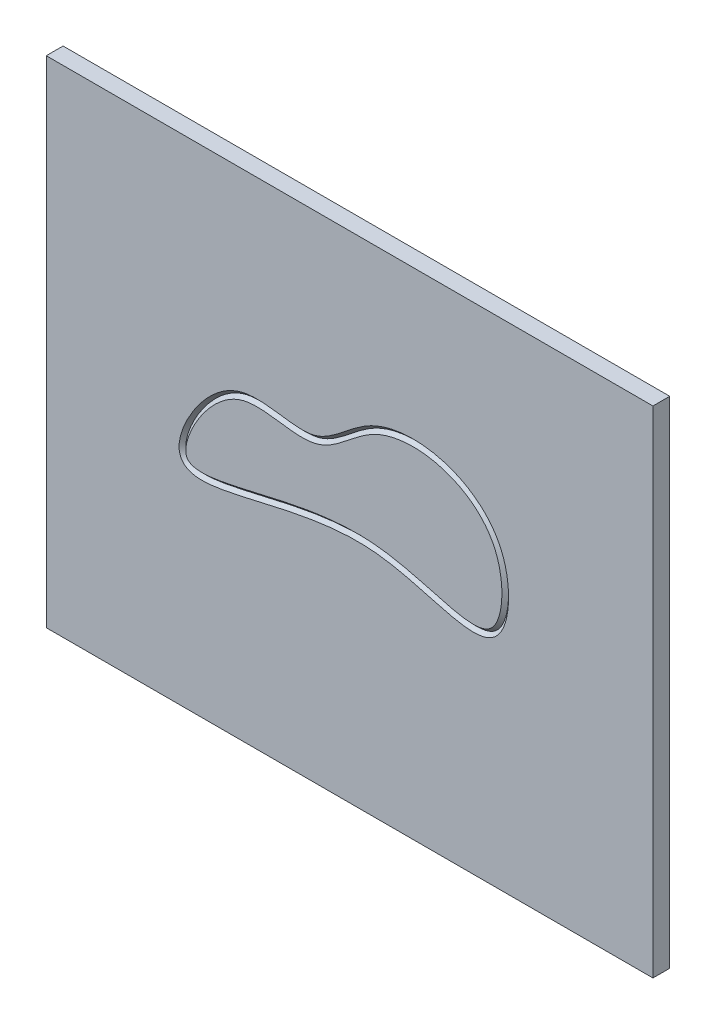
ISO-10303-21;
HEADER;
FILE_DESCRIPTION(('STEP AP214'),'2;1');
FILE_NAME('part.step','',(''),(''),'','','');
FILE_SCHEMA(('AUTOMOTIVE_DESIGN { 1 0 10303 214 1 1 1 1 }'));
ENDSEC;
DATA;
#1=APPLICATION_CONTEXT('core data for automotive mechanical design processes');
#2=APPLICATION_PROTOCOL_DEFINITION('international standard','automotive_design',2000,#1);
#3=PRODUCT_CONTEXT('',#1,'mechanical');
#4=PRODUCT('Part','Part','',(#3));
#5=PRODUCT_RELATED_PRODUCT_CATEGORY('part','',(#4));
#6=PRODUCT_DEFINITION_FORMATION('','',#4);
#7=PRODUCT_DEFINITION_CONTEXT('part definition',#1,'design');
#8=PRODUCT_DEFINITION('design','',#6,#7);
#9=PRODUCT_DEFINITION_SHAPE('','',#8);
#10=(LENGTH_UNIT() NAMED_UNIT(*) SI_UNIT(.MILLI.,.METRE.));
#11=(NAMED_UNIT(*) PLANE_ANGLE_UNIT() SI_UNIT($,.RADIAN.));
#12=(NAMED_UNIT(*) SI_UNIT($,.STERADIAN.) SOLID_ANGLE_UNIT());
#13=UNCERTAINTY_MEASURE_WITH_UNIT(LENGTH_MEASURE(1.E-05),#10,'distance_accuracy_value','');
#14=(GEOMETRIC_REPRESENTATION_CONTEXT(3) GLOBAL_UNCERTAINTY_ASSIGNED_CONTEXT((#13)) GLOBAL_UNIT_ASSIGNED_CONTEXT((#10,
#11,#12)) REPRESENTATION_CONTEXT('',''));
#15=CARTESIAN_POINT('',(0.,0.,0.));
#16=DIRECTION('',(0.,0.,1.));
#17=DIRECTION('',(1.,0.,0.));
#18=AXIS2_PLACEMENT_3D('',#15,#16,#17);
#19=CARTESIAN_POINT('',(0.,442.323223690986,15.));
#20=DIRECTION('',(0.,0.,-1.));
#21=DIRECTION('',(-1.,0.,0.));
#22=AXIS2_PLACEMENT_3D('',#19,#20,#21);
#23=PLANE('',#22);
#24=CARTESIAN_POINT('',(238.94227801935,268.42674909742,15.));
#25=CARTESIAN_POINT('',(233.076366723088,266.986429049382,15.));
#26=CARTESIAN_POINT('',(220.373399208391,267.218195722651,15.));
#27=CARTESIAN_POINT('',(202.101285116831,270.366087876,15.));
#28=CARTESIAN_POINT('',(187.098912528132,271.250733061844,15.));
#29=CARTESIAN_POINT('',(177.870382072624,270.372084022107,15.));
#30=CARTESIAN_POINT('',(170.392286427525,268.332501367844,15.));
#31=CARTESIAN_POINT('',(163.071572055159,265.281610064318,15.));
#32=CARTESIAN_POINT('',(153.135729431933,258.930835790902,15.));
#33=CARTESIAN_POINT('',(141.862274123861,248.195327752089,15.));
#34=CARTESIAN_POINT('',(131.624091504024,234.615519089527,15.));
#35=CARTESIAN_POINT('',(124.534237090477,221.770129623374,15.));
#36=CARTESIAN_POINT('',(120.274187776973,210.775490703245,15.));
#37=CARTESIAN_POINT('',(118.798024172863,204.024514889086,15.));
#38=CARTESIAN_POINT('',(118.572542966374,200.302872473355,15.));
#39=CARTESIAN_POINT('',(118.575468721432,198.255373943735,15.));
#40=CARTESIAN_POINT('',(118.772703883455,196.039969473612,15.));
#41=CARTESIAN_POINT('',(119.462313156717,193.350755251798,15.));
#42=CARTESIAN_POINT('',(120.605729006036,190.92483039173,15.));
#43=CARTESIAN_POINT('',(122.253965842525,188.74196610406,15.));
#44=CARTESIAN_POINT('',(124.396872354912,186.912238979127,15.));
#45=CARTESIAN_POINT('',(126.976524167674,185.495920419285,15.));
#46=CARTESIAN_POINT('',(129.839604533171,184.502470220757,15.));
#47=CARTESIAN_POINT('',(132.958956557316,183.865587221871,15.));
#48=CARTESIAN_POINT('',(137.412285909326,183.425674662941,15.));
#49=CARTESIAN_POINT('',(143.562085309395,183.520093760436,15.));
#50=CARTESIAN_POINT('',(161.679751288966,185.528291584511,15.));
#51=CARTESIAN_POINT('',(198.086066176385,194.651377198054,15.));
#52=CARTESIAN_POINT('',(248.574302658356,205.127435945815,15.));
#53=CARTESIAN_POINT('',(287.223477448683,206.412172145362,15.));
#54=CARTESIAN_POINT('',(323.891948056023,200.747530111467,15.));
#55=CARTESIAN_POINT('',(350.771567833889,192.014741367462,15.));
#56=CARTESIAN_POINT('',(370.239796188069,188.12230228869,15.));
#57=CARTESIAN_POINT('',(378.062168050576,187.181368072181,15.));
#58=CARTESIAN_POINT('',(385.35476326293,187.190783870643,15.));
#59=CARTESIAN_POINT('',(392.108143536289,188.421213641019,15.));
#60=CARTESIAN_POINT('',(397.71009229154,190.964066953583,15.));
#61=CARTESIAN_POINT('',(401.523625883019,194.061252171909,15.));
#62=CARTESIAN_POINT('',(403.858164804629,196.728611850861,15.));
#63=CARTESIAN_POINT('',(405.974549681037,199.715404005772,15.));
#64=CARTESIAN_POINT('',(408.172973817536,203.885357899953,15.));
#65=CARTESIAN_POINT('',(410.242740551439,209.668937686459,15.));
#66=CARTESIAN_POINT('',(412.458317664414,219.208797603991,15.));
#67=CARTESIAN_POINT('',(413.362999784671,233.532909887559,15.));
#68=CARTESIAN_POINT('',(410.926313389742,250.692650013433,15.));
#69=CARTESIAN_POINT('',(406.737447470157,262.592202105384,15.));
#70=CARTESIAN_POINT('',(401.105772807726,273.532260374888,15.));
#71=CARTESIAN_POINT('',(392.796644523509,284.478192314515,15.));
#72=CARTESIAN_POINT('',(378.655432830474,295.840277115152,15.));
#73=CARTESIAN_POINT('',(362.295032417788,303.984449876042,15.));
#74=CARTESIAN_POINT('',(344.574552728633,308.846171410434,15.));
#75=CARTESIAN_POINT('',(325.583498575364,310.399047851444,15.));
#76=CARTESIAN_POINT('',(307.009959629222,308.149906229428,15.));
#77=CARTESIAN_POINT('',(294.513894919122,303.62812566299,15.));
#78=CARTESIAN_POINT('',(283.017290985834,297.599141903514,15.));
#79=CARTESIAN_POINT('',(271.061200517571,288.923435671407,15.));
#80=CARTESIAN_POINT('',(255.412215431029,275.754969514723,15.));
#81=CARTESIAN_POINT('',(244.74953020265,269.852665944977,15.));
#82=CARTESIAN_POINT('',(238.94227801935,268.42674909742,15.));
#83=B_SPLINE_CURVE_WITH_KNOTS('',3,(#24,#25,#26,#27,#28,#29,#30,#31,#32,#33,#34,#35,#36,#37,#38,
#39,#40,#41,#42,#43,#44,#45,#46,#47,#48,#49,#50,#51,#52,#53,#54,#55,#56,#57,#58,#59,#60,#61,#62,
#63,#64,#65,#66,#67,#68,#69,#70,#71,#72,#73,#74,#75,#76,#77,#78,#79,#80,#81,#82),.UNSPECIFIED.,
.T.,.F.,(4,1,1,1,1,1,1,1,1,1,1,1,1,1,1,1,1,1,1,1,1,1,1,1,1,1,1,1,1,1,1,1,1,1,1,1,1,1,1,1,1,1,1,
1,1,1,1,1,1,1,1,1,1,1,1,1,4),(0.,0.03125,0.0625,0.078125,0.09375,0.100630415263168,0.109375,
0.125000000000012,0.145833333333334,0.166666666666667,0.1875,0.203125,0.21875,0.223293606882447,
0.225,0.23125,0.2375,0.24375,0.25,0.257,0.264,0.271,0.278,0.285,0.298750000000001,0.3125,0.375,
0.4375,0.473210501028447,0.499999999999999,0.5625,0.575,0.5875,0.6,0.612499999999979,
0.62500000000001,0.634375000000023,0.639427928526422,0.64375,0.653125,0.6625,0.671875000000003,
0.6953125,0.71875,0.736109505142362,0.742187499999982,0.765625,0.7890625,0.8125,0.8359375,
0.859375,0.885625,0.908781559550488,0.911874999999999,0.938125,0.9690625,1.),.UNSPECIFIED.);
#84=CARTESIAN_POINT('',(238.94227801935,268.42674909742,15.));
#85=VERTEX_POINT('',#84);
#86=EDGE_CURVE('E132',#85,#85,#83,.T.);
#87=ORIENTED_EDGE('',*,*,#86,.F.);
#88=EDGE_LOOP('',(#87));
#89=FACE_BOUND('',#88,.T.);
#90=DIRECTION('',(0.,-1.,0.));
#91=VECTOR('',#90,1.);
#92=CARTESIAN_POINT('',(0.,0.,15.));
#93=LINE('',#92,#91);
#94=CARTESIAN_POINT('',(0.,442.323223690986,15.));
#95=VERTEX_POINT('',#94);
#96=CARTESIAN_POINT('',(0.,0.,15.));
#97=VERTEX_POINT('',#96);
#98=EDGE_CURVE('E102',#95,#97,#93,.T.);
#99=ORIENTED_EDGE('',*,*,#98,.T.);
#100=DIRECTION('',(1.,0.,0.));
#101=VECTOR('',#100,1.);
#102=CARTESIAN_POINT('',(0.,0.,15.));
#103=LINE('',#102,#101);
#104=CARTESIAN_POINT('',(541.669056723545,0.,15.));
#105=VERTEX_POINT('',#104);
#106=EDGE_CURVE('E98',#97,#105,#103,.T.);
#107=ORIENTED_EDGE('',*,*,#106,.T.);
#108=DIRECTION('',(0.,1.,0.));
#109=VECTOR('',#108,1.);
#110=CARTESIAN_POINT('',(541.669056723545,0.,15.));
#111=LINE('',#110,#109);
#112=CARTESIAN_POINT('',(541.669056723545,442.323223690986,15.));
#113=VERTEX_POINT('',#112);
#114=EDGE_CURVE('E100',#105,#113,#111,.T.);
#115=ORIENTED_EDGE('',*,*,#114,.T.);
#116=DIRECTION('',(-1.,0.,0.));
#117=VECTOR('',#116,1.);
#118=CARTESIAN_POINT('',(0.,442.323223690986,15.));
#119=LINE('',#118,#117);
#120=EDGE_CURVE('E68',#113,#95,#119,.T.);
#121=ORIENTED_EDGE('',*,*,#120,.T.);
#122=EDGE_LOOP('',(#99,#107,#115,#121));
#123=FACE_BOUND('',#122,.T.);
#124=ADVANCED_FACE('F51',(#89,#123),#23,.F.);
#125=CARTESIAN_POINT('',(0.,0.,15.));
#126=DIRECTION('',(1.,0.,0.));
#127=DIRECTION('',(0.,0.,-1.));
#128=AXIS2_PLACEMENT_3D('',#125,#126,#127);
#129=PLANE('',#128);
#130=DIRECTION('',(0.,-1.,0.));
#131=VECTOR('',#130,1.);
#132=CARTESIAN_POINT('',(0.,0.,0.));
#133=LINE('',#132,#131);
#134=CARTESIAN_POINT('',(0.,442.323223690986,0.));
#135=VERTEX_POINT('',#134);
#136=CARTESIAN_POINT('',(0.,0.,0.));
#137=VERTEX_POINT('',#136);
#138=EDGE_CURVE('E114',#135,#137,#133,.T.);
#139=ORIENTED_EDGE('',*,*,#138,.T.);
#140=DIRECTION('',(0.,0.,-1.));
#141=VECTOR('',#140,1.);
#142=CARTESIAN_POINT('',(0.,0.,15.));
#143=LINE('',#142,#141);
#144=EDGE_CURVE('E12',#97,#137,#143,.T.);
#145=ORIENTED_EDGE('',*,*,#144,.F.);
#146=ORIENTED_EDGE('',*,*,#98,.F.);
#147=DIRECTION('',(0.,0.,-1.));
#148=VECTOR('',#147,1.);
#149=CARTESIAN_POINT('',(0.,442.323223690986,15.));
#150=LINE('',#149,#148);
#151=EDGE_CURVE('E110',#95,#135,#150,.T.);
#152=ORIENTED_EDGE('',*,*,#151,.T.);
#153=EDGE_LOOP('',(#139,#145,#146,#152));
#154=FACE_BOUND('',#153,.T.);
#155=ADVANCED_FACE('F53',(#154),#129,.F.);
#156=CARTESIAN_POINT('',(0.,0.,15.));
#157=DIRECTION('',(0.,1.,0.));
#158=DIRECTION('',(0.,0.,1.));
#159=AXIS2_PLACEMENT_3D('',#156,#157,#158);
#160=PLANE('',#159);
#161=DIRECTION('',(1.,0.,0.));
#162=VECTOR('',#161,1.);
#163=CARTESIAN_POINT('',(0.,0.,0.));
#164=LINE('',#163,#162);
#165=CARTESIAN_POINT('',(541.669056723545,0.,0.));
#166=VERTEX_POINT('',#165);
#167=EDGE_CURVE('E106',#137,#166,#164,.T.);
#168=ORIENTED_EDGE('',*,*,#167,.T.);
#169=DIRECTION('',(0.,0.,-1.));
#170=VECTOR('',#169,1.);
#171=CARTESIAN_POINT('',(541.669056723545,0.,15.));
#172=LINE('',#171,#170);
#173=EDGE_CURVE('E60',#105,#166,#172,.T.);
#174=ORIENTED_EDGE('',*,*,#173,.F.);
#175=ORIENTED_EDGE('',*,*,#106,.F.);
#176=ORIENTED_EDGE('',*,*,#144,.T.);
#177=EDGE_LOOP('',(#168,#174,#175,#176));
#178=FACE_BOUND('',#177,.T.);
#179=ADVANCED_FACE('F105',(#178),#160,.F.);
#180=CARTESIAN_POINT('',(541.669056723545,0.,15.));
#181=DIRECTION('',(-1.,0.,0.));
#182=DIRECTION('',(0.,0.,1.));
#183=AXIS2_PLACEMENT_3D('',#180,#181,#182);
#184=PLANE('',#183);
#185=DIRECTION('',(0.,1.,0.));
#186=VECTOR('',#185,1.);
#187=CARTESIAN_POINT('',(541.669056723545,0.,0.));
#188=LINE('',#187,#186);
#189=CARTESIAN_POINT('',(541.669056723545,442.323223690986,0.));
#190=VERTEX_POINT('',#189);
#191=EDGE_CURVE('E85',#166,#190,#188,.T.);
#192=ORIENTED_EDGE('',*,*,#191,.T.);
#193=DIRECTION('',(0.,0.,-1.));
#194=VECTOR('',#193,1.);
#195=CARTESIAN_POINT('',(541.669056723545,442.323223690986,15.));
#196=LINE('',#195,#194);
#197=EDGE_CURVE('E107',#113,#190,#196,.T.);
#198=ORIENTED_EDGE('',*,*,#197,.F.);
#199=ORIENTED_EDGE('',*,*,#114,.F.);
#200=ORIENTED_EDGE('',*,*,#173,.T.);
#201=EDGE_LOOP('',(#192,#198,#199,#200));
#202=FACE_BOUND('',#201,.T.);
#203=ADVANCED_FACE('F108',(#202),#184,.F.);
#204=CARTESIAN_POINT('',(0.,442.323223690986,15.));
#205=DIRECTION('',(0.,-1.,0.));
#206=DIRECTION('',(0.,0.,-1.));
#207=AXIS2_PLACEMENT_3D('',#204,#205,#206);
#208=PLANE('',#207);
#209=DIRECTION('',(-1.,0.,0.));
#210=VECTOR('',#209,1.);
#211=CARTESIAN_POINT('',(0.,442.323223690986,0.));
#212=LINE('',#211,#210);
#213=EDGE_CURVE('E91',#190,#135,#212,.T.);
#214=ORIENTED_EDGE('',*,*,#213,.T.);
#215=ORIENTED_EDGE('',*,*,#151,.F.);
#216=ORIENTED_EDGE('',*,*,#120,.F.);
#217=ORIENTED_EDGE('',*,*,#197,.T.);
#218=EDGE_LOOP('',(#214,#215,#216,#217));
#219=FACE_BOUND('',#218,.T.);
#220=ADVANCED_FACE('F122',(#219),#208,.F.);
#221=CARTESIAN_POINT('',(0.,442.323223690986,0.));
#222=DIRECTION('',(0.,0.,-1.));
#223=DIRECTION('',(-1.,0.,0.));
#224=AXIS2_PLACEMENT_3D('',#221,#222,#223);
#225=PLANE('',#224);
#226=ORIENTED_EDGE('',*,*,#138,.F.);
#227=ORIENTED_EDGE('',*,*,#213,.F.);
#228=ORIENTED_EDGE('',*,*,#191,.F.);
#229=ORIENTED_EDGE('',*,*,#167,.F.);
#230=EDGE_LOOP('',(#226,#227,#228,#229));
#231=FACE_BOUND('',#230,.T.);
#232=ADVANCED_FACE('F125',(#231),#225,.T.);
#233=CARTESIAN_POINT('',(238.94227801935,268.42674909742,15.));
#234=CARTESIAN_POINT('',(233.076366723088,266.986429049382,15.));
#235=CARTESIAN_POINT('',(220.373399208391,267.218195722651,15.));
#236=CARTESIAN_POINT('',(202.101285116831,270.366087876,15.));
#237=CARTESIAN_POINT('',(187.098912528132,271.250733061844,15.));
#238=CARTESIAN_POINT('',(177.870382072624,270.372084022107,15.));
#239=CARTESIAN_POINT('',(170.392286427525,268.332501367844,15.));
#240=CARTESIAN_POINT('',(163.071572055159,265.281610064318,15.));
#241=CARTESIAN_POINT('',(153.135729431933,258.930835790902,15.));
#242=CARTESIAN_POINT('',(141.862274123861,248.195327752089,15.));
#243=CARTESIAN_POINT('',(131.624091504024,234.615519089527,15.));
#244=CARTESIAN_POINT('',(124.534237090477,221.770129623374,15.));
#245=CARTESIAN_POINT('',(120.274187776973,210.775490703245,15.));
#246=CARTESIAN_POINT('',(118.798024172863,204.024514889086,15.));
#247=CARTESIAN_POINT('',(118.572542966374,200.302872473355,15.));
#248=CARTESIAN_POINT('',(118.575468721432,198.255373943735,15.));
#249=CARTESIAN_POINT('',(118.772703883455,196.039969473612,15.));
#250=CARTESIAN_POINT('',(119.462313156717,193.350755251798,15.));
#251=CARTESIAN_POINT('',(120.605729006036,190.92483039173,15.));
#252=CARTESIAN_POINT('',(122.253965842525,188.74196610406,15.));
#253=CARTESIAN_POINT('',(124.396872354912,186.912238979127,15.));
#254=CARTESIAN_POINT('',(126.976524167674,185.495920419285,15.));
#255=CARTESIAN_POINT('',(129.839604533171,184.502470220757,15.));
#256=CARTESIAN_POINT('',(132.958956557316,183.865587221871,15.));
#257=CARTESIAN_POINT('',(137.412285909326,183.425674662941,15.));
#258=CARTESIAN_POINT('',(143.562085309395,183.520093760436,15.));
#259=CARTESIAN_POINT('',(161.679751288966,185.528291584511,15.));
#260=CARTESIAN_POINT('',(198.086066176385,194.651377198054,15.));
#261=CARTESIAN_POINT('',(248.574302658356,205.127435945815,15.));
#262=CARTESIAN_POINT('',(287.223477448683,206.412172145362,15.));
#263=CARTESIAN_POINT('',(323.891948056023,200.747530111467,15.));
#264=CARTESIAN_POINT('',(350.771567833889,192.014741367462,15.));
#265=CARTESIAN_POINT('',(370.239796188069,188.12230228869,15.));
#266=CARTESIAN_POINT('',(378.062168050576,187.181368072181,15.));
#267=CARTESIAN_POINT('',(385.35476326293,187.190783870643,15.));
#268=CARTESIAN_POINT('',(392.108143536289,188.421213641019,15.));
#269=CARTESIAN_POINT('',(397.71009229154,190.964066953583,15.));
#270=CARTESIAN_POINT('',(401.523625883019,194.061252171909,15.));
#271=CARTESIAN_POINT('',(403.858164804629,196.728611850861,15.));
#272=CARTESIAN_POINT('',(405.974549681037,199.715404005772,15.));
#273=CARTESIAN_POINT('',(408.172973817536,203.885357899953,15.));
#274=CARTESIAN_POINT('',(410.242740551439,209.668937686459,15.));
#275=CARTESIAN_POINT('',(412.458317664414,219.208797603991,15.));
#276=CARTESIAN_POINT('',(413.362999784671,233.532909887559,15.));
#277=CARTESIAN_POINT('',(410.926313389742,250.692650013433,15.));
#278=CARTESIAN_POINT('',(406.737447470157,262.592202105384,15.));
#279=CARTESIAN_POINT('',(401.105772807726,273.532260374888,15.));
#280=CARTESIAN_POINT('',(392.796644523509,284.478192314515,15.));
#281=CARTESIAN_POINT('',(378.655432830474,295.840277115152,15.));
#282=CARTESIAN_POINT('',(362.295032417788,303.984449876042,15.));
#283=CARTESIAN_POINT('',(344.574552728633,308.846171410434,15.));
#284=CARTESIAN_POINT('',(325.583498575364,310.399047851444,15.));
#285=CARTESIAN_POINT('',(307.009959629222,308.149906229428,15.));
#286=CARTESIAN_POINT('',(294.513894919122,303.62812566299,15.));
#287=CARTESIAN_POINT('',(283.017290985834,297.599141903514,15.));
#288=CARTESIAN_POINT('',(271.061200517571,288.923435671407,15.));
#289=CARTESIAN_POINT('',(255.412215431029,275.754969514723,15.));
#290=CARTESIAN_POINT('',(244.74953020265,269.852665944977,15.));
#291=CARTESIAN_POINT('',(238.94227801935,268.42674909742,15.));
#292=CARTESIAN_POINT('',(239.659202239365,265.51367174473,12.));
#293=CARTESIAN_POINT('',(233.38564723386,263.969715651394,12.));
#294=CARTESIAN_POINT('',(219.848762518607,264.24297632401,12.));
#295=CARTESIAN_POINT('',(201.672721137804,267.392493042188,12.));
#296=CARTESIAN_POINT('',(187.110627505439,268.239876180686,12.));
#297=CARTESIAN_POINT('',(178.366641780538,267.39403053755,12.));
#298=CARTESIAN_POINT('',(171.371004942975,265.493508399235,12.));
#299=CARTESIAN_POINT('',(164.520624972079,262.631595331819,12.));
#300=CARTESIAN_POINT('',(155.033101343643,256.58661291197,12.));
#301=CARTESIAN_POINT('',(144.125350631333,246.205740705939,12.));
#302=CARTESIAN_POINT('',(134.146977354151,232.975993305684,12.));
#303=CARTESIAN_POINT('',(127.245324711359,220.463660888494,12.));
#304=CARTESIAN_POINT('',(123.142264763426,209.865390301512,12.));
#305=CARTESIAN_POINT('',(121.771629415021,203.517725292,12.));
#306=CARTESIAN_POINT('',(121.572685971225,200.196225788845,12.));
#307=CARTESIAN_POINT('',(121.575562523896,198.406722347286,12.));
#308=CARTESIAN_POINT('',(121.746116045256,196.52814265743,12.));
#309=CARTESIAN_POINT('',(122.307810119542,194.357198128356,12.));
#310=CARTESIAN_POINT('',(123.195819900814,192.481333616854,12.));
#311=CARTESIAN_POINT('',(124.448030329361,190.823404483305,12.));
#312=CARTESIAN_POINT('',(126.098438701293,189.408885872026,12.));
#313=CARTESIAN_POINT('',(128.179082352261,188.259767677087,12.));
#314=CARTESIAN_POINT('',(130.614396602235,187.409644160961,12.));
#315=CARTESIAN_POINT('',(133.389943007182,186.839720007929,12.));
#316=CARTESIAN_POINT('',(137.488142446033,186.432032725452,12.));
#317=CARTESIAN_POINT('',(143.341335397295,186.515918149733,12.));
#318=CARTESIAN_POINT('',(160.992882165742,188.466318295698,12.));
#319=CARTESIAN_POINT('',(197.368729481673,197.546429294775,12.));
#320=CARTESIAN_POINT('',(248.092154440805,208.128916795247,12.));
#321=CARTESIAN_POINT('',(287.41116060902,209.392473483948,12.));
#322=CARTESIAN_POINT('',(324.687908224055,203.674074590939,12.));
#323=CARTESIAN_POINT('',(351.667102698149,194.888919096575,12.));
#324=CARTESIAN_POINT('',(370.736844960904,191.083976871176,12.));
#325=CARTESIAN_POINT('',(378.272600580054,190.180790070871,12.));
#326=CARTESIAN_POINT('',(385.123236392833,190.197333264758,12.));
#327=CARTESIAN_POINT('',(391.240623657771,191.325833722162,12.));
#328=CARTESIAN_POINT('',(396.131966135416,193.555794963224,12.));
#329=CARTESIAN_POINT('',(399.442444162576,196.242875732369,12.));
#330=CARTESIAN_POINT('',(401.497763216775,198.587302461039,12.));
#331=CARTESIAN_POINT('',(403.387133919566,201.253908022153,12.));
#332=CARTESIAN_POINT('',(405.40934709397,205.07637613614,12.));
#333=CARTESIAN_POINT('',(407.353667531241,210.501403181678,12.));
#334=CARTESIAN_POINT('',(409.465456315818,219.580577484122,12.));
#335=CARTESIAN_POINT('',(410.348641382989,233.401483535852,12.));
#336=CARTESIAN_POINT('',(407.980568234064,250.017562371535,12.));
#337=CARTESIAN_POINT('',(403.965634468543,261.42437520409,12.));
#338=CARTESIAN_POINT('',(398.576402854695,271.887239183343,12.));
#339=CARTESIAN_POINT('',(390.637300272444,282.351430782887,12.));
#340=CARTESIAN_POINT('',(377.037834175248,293.286739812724,12.));
#341=CARTESIAN_POINT('',(361.226513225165,301.16146301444,12.));
#342=CARTESIAN_POINT('',(344.049181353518,305.874358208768,12.));
#343=CARTESIAN_POINT('',(325.643782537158,307.382176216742,12.));
#344=CARTESIAN_POINT('',(307.666742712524,305.189632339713,12.));
#345=CARTESIAN_POINT('',(295.712230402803,300.872503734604,12.));
#346=CARTESIAN_POINT('',(284.639447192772,295.059406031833,12.));
#347=CARTESIAN_POINT('',(272.988522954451,286.632999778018,12.));
#348=CARTESIAN_POINT('',(257.321582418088,273.393506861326,12.));
#349=CARTESIAN_POINT('',(245.870021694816,267.042188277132,12.));
#350=CARTESIAN_POINT('',(239.659202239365,265.51367174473,12.));
#351=B_SPLINE_SURFACE_WITH_KNOTS('',1,3,((#233,#234,#235,#236,#237,#238,#239,#240,#241,#242,
#243,#244,#245,#246,#247,#248,#249,#250,#251,#252,#253,#254,#255,#256,#257,#258,#259,#260,#261,
#262,#263,#264,#265,#266,#267,#268,#269,#270,#271,#272,#273,#274,#275,#276,#277,#278,#279,#280,
#281,#282,#283,#284,#285,#286,#287,#288,#289,#290,#291),(#292,#293,#294,#295,#296,#297,#298,
#299,#300,#301,#302,#303,#304,#305,#306,#307,#308,#309,#310,#311,#312,#313,#314,#315,#316,#317,
#318,#319,#320,#321,#322,#323,#324,#325,#326,#327,#328,#329,#330,#331,#332,#333,#334,#335,#336,
#337,#338,#339,#340,#341,#342,#343,#344,#345,#346,#347,#348,#349,#350)),.UNSPECIFIED.,.F.,.T.,
.F.,(2,2),(4,1,1,1,1,1,1,1,1,1,1,1,1,1,1,1,1,1,1,1,1,1,1,1,1,1,1,1,1,1,1,1,1,1,1,1,1,1,1,1,1,1,
1,1,1,1,1,1,1,1,1,1,1,1,1,1,4),(0.707106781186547,1.),(0.,0.03125,0.0625,0.078125,0.09375,
0.100630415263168,0.109375,0.125000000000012,0.145833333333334,0.166666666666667,0.1875,
0.203125,0.21875,0.223293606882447,0.225,0.23125,0.2375,0.24375,0.25,0.257,0.264,0.271,0.278,
0.285,0.298750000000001,0.3125,0.375,0.4375,0.473210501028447,0.499999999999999,0.5625,0.575,
0.5875,0.6,0.612499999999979,0.62500000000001,0.634375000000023,0.639427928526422,0.64375,
0.653125,0.6625,0.671875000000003,0.6953125,0.71875,0.736109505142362,0.742187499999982,
0.765625,0.7890625,0.8125,0.8359375,0.859375,0.885625,0.908781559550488,0.911874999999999,
0.938125,0.9690625,1.),.UNSPECIFIED.);
#352=CARTESIAN_POINT('',(239.659202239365,265.51367174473,12.));
#353=CARTESIAN_POINT('',(233.38564723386,263.969715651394,12.));
#354=CARTESIAN_POINT('',(219.848762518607,264.24297632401,12.));
#355=CARTESIAN_POINT('',(201.672721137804,267.392493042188,12.));
#356=CARTESIAN_POINT('',(187.110627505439,268.239876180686,12.));
#357=CARTESIAN_POINT('',(178.366641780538,267.39403053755,12.));
#358=CARTESIAN_POINT('',(171.371004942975,265.493508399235,12.));
#359=CARTESIAN_POINT('',(164.520624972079,262.631595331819,12.));
#360=CARTESIAN_POINT('',(155.033101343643,256.58661291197,12.));
#361=CARTESIAN_POINT('',(144.125350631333,246.205740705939,12.));
#362=CARTESIAN_POINT('',(134.146977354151,232.975993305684,12.));
#363=CARTESIAN_POINT('',(127.245324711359,220.463660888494,12.));
#364=CARTESIAN_POINT('',(123.142264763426,209.865390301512,12.));
#365=CARTESIAN_POINT('',(121.771629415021,203.517725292,12.));
#366=CARTESIAN_POINT('',(121.572685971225,200.196225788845,12.));
#367=CARTESIAN_POINT('',(121.575562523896,198.406722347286,12.));
#368=CARTESIAN_POINT('',(121.746116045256,196.52814265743,12.));
#369=CARTESIAN_POINT('',(122.307810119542,194.357198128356,12.));
#370=CARTESIAN_POINT('',(123.195819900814,192.481333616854,12.));
#371=CARTESIAN_POINT('',(124.448030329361,190.823404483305,12.));
#372=CARTESIAN_POINT('',(126.098438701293,189.408885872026,12.));
#373=CARTESIAN_POINT('',(128.179082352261,188.259767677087,12.));
#374=CARTESIAN_POINT('',(130.614396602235,187.409644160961,12.));
#375=CARTESIAN_POINT('',(133.389943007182,186.839720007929,12.));
#376=CARTESIAN_POINT('',(137.488142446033,186.432032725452,12.));
#377=CARTESIAN_POINT('',(143.341335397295,186.515918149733,12.));
#378=CARTESIAN_POINT('',(160.992882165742,188.466318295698,12.));
#379=CARTESIAN_POINT('',(197.368729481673,197.546429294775,12.));
#380=CARTESIAN_POINT('',(248.092154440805,208.128916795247,12.));
#381=CARTESIAN_POINT('',(287.41116060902,209.392473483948,12.));
#382=CARTESIAN_POINT('',(324.687908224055,203.674074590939,12.));
#383=CARTESIAN_POINT('',(351.667102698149,194.888919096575,12.));
#384=CARTESIAN_POINT('',(370.736844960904,191.083976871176,12.));
#385=CARTESIAN_POINT('',(378.272600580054,190.180790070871,12.));
#386=CARTESIAN_POINT('',(385.123236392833,190.197333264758,12.));
#387=CARTESIAN_POINT('',(391.240623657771,191.325833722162,12.));
#388=CARTESIAN_POINT('',(396.131966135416,193.555794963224,12.));
#389=CARTESIAN_POINT('',(399.442444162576,196.242875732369,12.));
#390=CARTESIAN_POINT('',(401.497763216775,198.587302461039,12.));
#391=CARTESIAN_POINT('',(403.387133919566,201.253908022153,12.));
#392=CARTESIAN_POINT('',(405.40934709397,205.07637613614,12.));
#393=CARTESIAN_POINT('',(407.353667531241,210.501403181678,12.));
#394=CARTESIAN_POINT('',(409.465456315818,219.580577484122,12.));
#395=CARTESIAN_POINT('',(410.348641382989,233.401483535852,12.));
#396=CARTESIAN_POINT('',(407.980568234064,250.017562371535,12.));
#397=CARTESIAN_POINT('',(403.965634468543,261.42437520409,12.));
#398=CARTESIAN_POINT('',(398.576402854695,271.887239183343,12.));
#399=CARTESIAN_POINT('',(390.637300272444,282.351430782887,12.));
#400=CARTESIAN_POINT('',(377.037834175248,293.286739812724,12.));
#401=CARTESIAN_POINT('',(361.226513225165,301.16146301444,12.));
#402=CARTESIAN_POINT('',(344.049181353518,305.874358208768,12.));
#403=CARTESIAN_POINT('',(325.643782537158,307.382176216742,12.));
#404=CARTESIAN_POINT('',(307.666742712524,305.189632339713,12.));
#405=CARTESIAN_POINT('',(295.712230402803,300.872503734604,12.));
#406=CARTESIAN_POINT('',(284.639447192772,295.059406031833,12.));
#407=CARTESIAN_POINT('',(272.988522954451,286.632999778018,12.));
#408=CARTESIAN_POINT('',(257.321582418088,273.393506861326,12.));
#409=CARTESIAN_POINT('',(245.870021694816,267.042188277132,12.));
#410=CARTESIAN_POINT('',(239.659202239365,265.51367174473,12.));
#411=B_SPLINE_CURVE_WITH_KNOTS('',3,(#352,#353,#354,#355,#356,#357,#358,#359,#360,#361,#362,
#363,#364,#365,#366,#367,#368,#369,#370,#371,#372,#373,#374,#375,#376,#377,#378,#379,#380,#381,
#382,#383,#384,#385,#386,#387,#388,#389,#390,#391,#392,#393,#394,#395,#396,#397,#398,#399,#400,
#401,#402,#403,#404,#405,#406,#407,#408,#409,#410),.UNSPECIFIED.,.T.,.F.,(4,1,1,1,1,1,1,1,1,1,1,
1,1,1,1,1,1,1,1,1,1,1,1,1,1,1,1,1,1,1,1,1,1,1,1,1,1,1,1,1,1,1,1,1,1,1,1,1,1,1,1,1,1,1,1,1,4),
(0.,0.03125,0.0625,0.078125,0.09375,0.100630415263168,0.109375,0.125000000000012,
0.145833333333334,0.166666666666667,0.1875,0.203125,0.21875,0.223293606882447,0.225,0.23125,
0.2375,0.24375,0.25,0.257,0.264,0.271,0.278,0.285,0.298750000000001,0.3125,0.375,0.4375,
0.473210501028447,0.499999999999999,0.5625,0.575,0.5875,0.6,0.612499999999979,0.62500000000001,
0.634375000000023,0.639427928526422,0.64375,0.653125,0.6625,0.671875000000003,0.6953125,0.71875,
0.736109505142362,0.742187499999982,0.765625,0.7890625,0.8125,0.8359375,0.859375,0.885625,
0.908781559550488,0.911874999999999,0.938125,0.9690625,1.),.UNSPECIFIED.);
#412=CARTESIAN_POINT('',(239.659202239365,265.51367174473,12.));
#413=VERTEX_POINT('',#412);
#414=EDGE_CURVE('E140',#413,#413,#411,.T.);
#415=ORIENTED_EDGE('',*,*,#414,.F.);
#416=EDGE_LOOP('',(#415));
#417=FACE_BOUND('',#416,.T.);
#418=ORIENTED_EDGE('',*,*,#86,.T.);
#419=EDGE_LOOP('',(#418));
#420=FACE_BOUND('',#419,.T.);
#421=ADVANCED_FACE('F154',(#417,#420),#351,.F.);
#422=CARTESIAN_POINT('',(239.659202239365,265.51367174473,12.));
#423=CARTESIAN_POINT('',(233.38564723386,263.969715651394,12.));
#424=CARTESIAN_POINT('',(219.848762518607,264.24297632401,12.));
#425=CARTESIAN_POINT('',(201.672721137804,267.392493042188,12.));
#426=CARTESIAN_POINT('',(187.110627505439,268.239876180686,12.));
#427=CARTESIAN_POINT('',(178.366641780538,267.39403053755,12.));
#428=CARTESIAN_POINT('',(171.371004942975,265.493508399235,12.));
#429=CARTESIAN_POINT('',(164.520624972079,262.631595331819,12.));
#430=CARTESIAN_POINT('',(155.033101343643,256.58661291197,12.));
#431=CARTESIAN_POINT('',(144.125350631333,246.205740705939,12.));
#432=CARTESIAN_POINT('',(134.146977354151,232.975993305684,12.));
#433=CARTESIAN_POINT('',(127.245324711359,220.463660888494,12.));
#434=CARTESIAN_POINT('',(123.142264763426,209.865390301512,12.));
#435=CARTESIAN_POINT('',(121.771629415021,203.517725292,12.));
#436=CARTESIAN_POINT('',(121.572685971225,200.196225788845,12.));
#437=CARTESIAN_POINT('',(121.575562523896,198.406722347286,12.));
#438=CARTESIAN_POINT('',(121.746116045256,196.52814265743,12.));
#439=CARTESIAN_POINT('',(122.307810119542,194.357198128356,12.));
#440=CARTESIAN_POINT('',(123.195819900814,192.481333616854,12.));
#441=CARTESIAN_POINT('',(124.448030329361,190.823404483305,12.));
#442=CARTESIAN_POINT('',(126.098438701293,189.408885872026,12.));
#443=CARTESIAN_POINT('',(128.179082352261,188.259767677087,12.));
#444=CARTESIAN_POINT('',(130.614396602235,187.409644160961,12.));
#445=CARTESIAN_POINT('',(133.389943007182,186.839720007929,12.));
#446=CARTESIAN_POINT('',(137.488142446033,186.432032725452,12.));
#447=CARTESIAN_POINT('',(143.341335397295,186.515918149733,12.));
#448=CARTESIAN_POINT('',(160.992882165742,188.466318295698,12.));
#449=CARTESIAN_POINT('',(197.368729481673,197.546429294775,12.));
#450=CARTESIAN_POINT('',(248.092154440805,208.128916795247,12.));
#451=CARTESIAN_POINT('',(287.41116060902,209.392473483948,12.));
#452=CARTESIAN_POINT('',(324.687908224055,203.674074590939,12.));
#453=CARTESIAN_POINT('',(351.667102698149,194.888919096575,12.));
#454=CARTESIAN_POINT('',(370.736844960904,191.083976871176,12.));
#455=CARTESIAN_POINT('',(378.272600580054,190.180790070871,12.));
#456=CARTESIAN_POINT('',(385.123236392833,190.197333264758,12.));
#457=CARTESIAN_POINT('',(391.240623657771,191.325833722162,12.));
#458=CARTESIAN_POINT('',(396.131966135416,193.555794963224,12.));
#459=CARTESIAN_POINT('',(399.442444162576,196.242875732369,12.));
#460=CARTESIAN_POINT('',(401.497763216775,198.587302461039,12.));
#461=CARTESIAN_POINT('',(403.387133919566,201.253908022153,12.));
#462=CARTESIAN_POINT('',(405.40934709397,205.07637613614,12.));
#463=CARTESIAN_POINT('',(407.353667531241,210.501403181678,12.));
#464=CARTESIAN_POINT('',(409.465456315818,219.580577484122,12.));
#465=CARTESIAN_POINT('',(410.348641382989,233.401483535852,12.));
#466=CARTESIAN_POINT('',(407.980568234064,250.017562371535,12.));
#467=CARTESIAN_POINT('',(403.965634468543,261.42437520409,12.));
#468=CARTESIAN_POINT('',(398.576402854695,271.887239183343,12.));
#469=CARTESIAN_POINT('',(390.637300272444,282.351430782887,12.));
#470=CARTESIAN_POINT('',(377.037834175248,293.286739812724,12.));
#471=CARTESIAN_POINT('',(361.226513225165,301.16146301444,12.));
#472=CARTESIAN_POINT('',(344.049181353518,305.874358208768,12.));
#473=CARTESIAN_POINT('',(325.643782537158,307.382176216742,12.));
#474=CARTESIAN_POINT('',(307.666742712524,305.189632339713,12.));
#475=CARTESIAN_POINT('',(295.712230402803,300.872503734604,12.));
#476=CARTESIAN_POINT('',(284.639447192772,295.059406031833,12.));
#477=CARTESIAN_POINT('',(272.988522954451,286.632999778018,12.));
#478=CARTESIAN_POINT('',(257.321582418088,273.393506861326,12.));
#479=CARTESIAN_POINT('',(245.870021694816,267.042188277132,12.));
#480=CARTESIAN_POINT('',(239.659202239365,265.51367174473,12.));
#481=CARTESIAN_POINT('',(240.376126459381,262.60059439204,15.));
#482=CARTESIAN_POINT('',(233.694927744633,260.953002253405,15.));
#483=CARTESIAN_POINT('',(219.324125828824,261.267756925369,15.));
#484=CARTESIAN_POINT('',(201.244157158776,264.418898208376,15.));
#485=CARTESIAN_POINT('',(187.122342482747,265.229019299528,15.));
#486=CARTESIAN_POINT('',(178.862901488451,264.415977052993,15.));
#487=CARTESIAN_POINT('',(172.349723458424,262.654515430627,15.));
#488=CARTESIAN_POINT('',(165.969677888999,259.981580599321,15.));
#489=CARTESIAN_POINT('',(156.930473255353,254.242390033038,15.));
#490=CARTESIAN_POINT('',(146.388427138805,244.216153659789,15.));
#491=CARTESIAN_POINT('',(136.669863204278,231.336467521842,15.));
#492=CARTESIAN_POINT('',(129.95641233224,219.157192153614,15.));
#493=CARTESIAN_POINT('',(126.010341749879,208.955289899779,15.));
#494=CARTESIAN_POINT('',(124.745234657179,203.010935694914,15.));
#495=CARTESIAN_POINT('',(124.572828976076,200.089579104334,15.));
#496=CARTESIAN_POINT('',(124.57565632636,198.558070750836,15.));
#497=CARTESIAN_POINT('',(124.719528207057,197.016315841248,15.));
#498=CARTESIAN_POINT('',(125.153307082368,195.363641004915,15.));
#499=CARTESIAN_POINT('',(125.785910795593,194.037836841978,15.));
#500=CARTESIAN_POINT('',(126.642094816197,192.904842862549,15.));
#501=CARTESIAN_POINT('',(127.800005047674,191.905532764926,15.));
#502=CARTESIAN_POINT('',(129.381640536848,191.023614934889,15.));
#503=CARTESIAN_POINT('',(131.389188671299,190.316818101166,15.));
#504=CARTESIAN_POINT('',(133.820929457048,189.813852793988,15.));
#505=CARTESIAN_POINT('',(137.56399898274,189.438390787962,15.));
#506=CARTESIAN_POINT('',(143.120585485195,189.51174253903,15.));
#507=CARTESIAN_POINT('',(160.306013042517,191.404345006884,15.));
#508=CARTESIAN_POINT('',(196.651392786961,200.441481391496,15.));
#509=CARTESIAN_POINT('',(247.610006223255,211.130397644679,15.));
#510=CARTESIAN_POINT('',(287.598843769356,212.372774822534,15.));
#511=CARTESIAN_POINT('',(325.483868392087,206.600619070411,15.));
#512=CARTESIAN_POINT('',(352.562637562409,197.763096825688,15.));
#513=CARTESIAN_POINT('',(371.23389373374,194.045651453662,15.));
#514=CARTESIAN_POINT('',(378.483033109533,193.180212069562,15.));
#515=CARTESIAN_POINT('',(384.891709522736,193.203882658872,15.));
#516=CARTESIAN_POINT('',(390.373103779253,194.230453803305,15.));
#517=CARTESIAN_POINT('',(394.553839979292,196.147522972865,15.));
#518=CARTESIAN_POINT('',(397.361262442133,198.424499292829,15.));
#519=CARTESIAN_POINT('',(399.137361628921,200.445993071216,15.));
#520=CARTESIAN_POINT('',(400.799718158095,202.792412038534,15.));
#521=CARTESIAN_POINT('',(402.645720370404,206.267394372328,15.));
#522=CARTESIAN_POINT('',(404.464594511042,211.333868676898,15.));
#523=CARTESIAN_POINT('',(406.472594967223,219.952357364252,15.));
#524=CARTESIAN_POINT('',(407.334282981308,233.270057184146,15.));
#525=CARTESIAN_POINT('',(405.034823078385,249.342474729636,15.));
#526=CARTESIAN_POINT('',(401.193821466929,260.256548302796,15.));
#527=CARTESIAN_POINT('',(396.047032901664,270.242217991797,15.));
#528=CARTESIAN_POINT('',(388.47795602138,280.224669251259,15.));
#529=CARTESIAN_POINT('',(375.420235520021,290.733202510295,15.));
#530=CARTESIAN_POINT('',(360.157994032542,298.338476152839,15.));
#531=CARTESIAN_POINT('',(343.523809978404,302.902545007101,15.));
#532=CARTESIAN_POINT('',(325.704066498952,304.365304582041,15.));
#533=CARTESIAN_POINT('',(308.323525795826,302.229358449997,15.));
#534=CARTESIAN_POINT('',(296.910565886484,298.116881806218,15.));
#535=CARTESIAN_POINT('',(286.26160339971,292.519670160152,15.));
#536=CARTESIAN_POINT('',(274.915845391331,284.342563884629,15.));
#537=CARTESIAN_POINT('',(259.230949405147,271.032044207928,15.));
#538=CARTESIAN_POINT('',(246.990513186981,264.231710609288,15.));
#539=CARTESIAN_POINT('',(240.376126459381,262.60059439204,15.));
#540=B_SPLINE_SURFACE_WITH_KNOTS('',1,3,((#422,#423,#424,#425,#426,#427,#428,#429,#430,#431,
#432,#433,#434,#435,#436,#437,#438,#439,#440,#441,#442,#443,#444,#445,#446,#447,#448,#449,#450,
#451,#452,#453,#454,#455,#456,#457,#458,#459,#460,#461,#462,#463,#464,#465,#466,#467,#468,#469,
#470,#471,#472,#473,#474,#475,#476,#477,#478,#479,#480),(#481,#482,#483,#484,#485,#486,#487,
#488,#489,#490,#491,#492,#493,#494,#495,#496,#497,#498,#499,#500,#501,#502,#503,#504,#505,#506,
#507,#508,#509,#510,#511,#512,#513,#514,#515,#516,#517,#518,#519,#520,#521,#522,#523,#524,#525,
#526,#527,#528,#529,#530,#531,#532,#533,#534,#535,#536,#537,#538,#539)),.UNSPECIFIED.,.F.,.T.,
.F.,(2,2),(4,1,1,1,1,1,1,1,1,1,1,1,1,1,1,1,1,1,1,1,1,1,1,1,1,1,1,1,1,1,1,1,1,1,1,1,1,1,1,1,1,1,
1,1,1,1,1,1,1,1,1,1,1,1,1,1,4),(0.,0.292893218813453),(0.,0.03125,0.0625,0.078125,0.09375,
0.100630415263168,0.109375,0.125000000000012,0.145833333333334,0.166666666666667,0.1875,
0.203125,0.21875,0.223293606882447,0.225,0.23125,0.2375,0.24375,0.25,0.257,0.264,0.271,0.278,
0.285,0.298750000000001,0.3125,0.375,0.4375,0.473210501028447,0.499999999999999,0.5625,0.575,
0.5875,0.6,0.612499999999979,0.62500000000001,0.634375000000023,0.639427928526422,0.64375,
0.653125,0.6625,0.671875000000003,0.6953125,0.71875,0.736109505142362,0.742187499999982,
0.765625,0.7890625,0.8125,0.8359375,0.859375,0.885625,0.908781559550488,0.911874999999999,
0.938125,0.9690625,1.),.UNSPECIFIED.);
#541=CARTESIAN_POINT('',(240.376126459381,262.60059439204,15.));
#542=CARTESIAN_POINT('',(233.694927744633,260.953002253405,15.));
#543=CARTESIAN_POINT('',(219.324125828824,261.267756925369,15.));
#544=CARTESIAN_POINT('',(201.244157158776,264.418898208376,15.));
#545=CARTESIAN_POINT('',(187.122342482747,265.229019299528,15.));
#546=CARTESIAN_POINT('',(178.862901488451,264.415977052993,15.));
#547=CARTESIAN_POINT('',(172.349723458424,262.654515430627,15.));
#548=CARTESIAN_POINT('',(165.969677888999,259.981580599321,15.));
#549=CARTESIAN_POINT('',(156.930473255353,254.242390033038,15.));
#550=CARTESIAN_POINT('',(146.388427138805,244.216153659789,15.));
#551=CARTESIAN_POINT('',(136.669863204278,231.336467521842,15.));
#552=CARTESIAN_POINT('',(129.95641233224,219.157192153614,15.));
#553=CARTESIAN_POINT('',(126.010341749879,208.955289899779,15.));
#554=CARTESIAN_POINT('',(124.745234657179,203.010935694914,15.));
#555=CARTESIAN_POINT('',(124.572828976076,200.089579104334,15.));
#556=CARTESIAN_POINT('',(124.57565632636,198.558070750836,15.));
#557=CARTESIAN_POINT('',(124.719528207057,197.016315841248,15.));
#558=CARTESIAN_POINT('',(125.153307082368,195.363641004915,15.));
#559=CARTESIAN_POINT('',(125.785910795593,194.037836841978,15.));
#560=CARTESIAN_POINT('',(126.642094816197,192.904842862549,15.));
#561=CARTESIAN_POINT('',(127.800005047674,191.905532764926,15.));
#562=CARTESIAN_POINT('',(129.381640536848,191.023614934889,15.));
#563=CARTESIAN_POINT('',(131.389188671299,190.316818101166,15.));
#564=CARTESIAN_POINT('',(133.820929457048,189.813852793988,15.));
#565=CARTESIAN_POINT('',(137.56399898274,189.438390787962,15.));
#566=CARTESIAN_POINT('',(143.120585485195,189.51174253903,15.));
#567=CARTESIAN_POINT('',(160.306013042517,191.404345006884,15.));
#568=CARTESIAN_POINT('',(196.651392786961,200.441481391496,15.));
#569=CARTESIAN_POINT('',(247.610006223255,211.130397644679,15.));
#570=CARTESIAN_POINT('',(287.598843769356,212.372774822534,15.));
#571=CARTESIAN_POINT('',(325.483868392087,206.600619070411,15.));
#572=CARTESIAN_POINT('',(352.562637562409,197.763096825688,15.));
#573=CARTESIAN_POINT('',(371.23389373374,194.045651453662,15.));
#574=CARTESIAN_POINT('',(378.483033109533,193.180212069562,15.));
#575=CARTESIAN_POINT('',(384.891709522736,193.203882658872,15.));
#576=CARTESIAN_POINT('',(390.373103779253,194.230453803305,15.));
#577=CARTESIAN_POINT('',(394.553839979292,196.147522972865,15.));
#578=CARTESIAN_POINT('',(397.361262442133,198.424499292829,15.));
#579=CARTESIAN_POINT('',(399.137361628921,200.445993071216,15.));
#580=CARTESIAN_POINT('',(400.799718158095,202.792412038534,15.));
#581=CARTESIAN_POINT('',(402.645720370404,206.267394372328,15.));
#582=CARTESIAN_POINT('',(404.464594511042,211.333868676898,15.));
#583=CARTESIAN_POINT('',(406.472594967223,219.952357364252,15.));
#584=CARTESIAN_POINT('',(407.334282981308,233.270057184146,15.));
#585=CARTESIAN_POINT('',(405.034823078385,249.342474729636,15.));
#586=CARTESIAN_POINT('',(401.193821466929,260.256548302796,15.));
#587=CARTESIAN_POINT('',(396.047032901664,270.242217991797,15.));
#588=CARTESIAN_POINT('',(388.47795602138,280.224669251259,15.));
#589=CARTESIAN_POINT('',(375.420235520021,290.733202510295,15.));
#590=CARTESIAN_POINT('',(360.157994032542,298.338476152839,15.));
#591=CARTESIAN_POINT('',(343.523809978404,302.902545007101,15.));
#592=CARTESIAN_POINT('',(325.704066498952,304.365304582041,15.));
#593=CARTESIAN_POINT('',(308.323525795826,302.229358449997,15.));
#594=CARTESIAN_POINT('',(296.910565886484,298.116881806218,15.));
#595=CARTESIAN_POINT('',(286.26160339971,292.519670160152,15.));
#596=CARTESIAN_POINT('',(274.915845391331,284.342563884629,15.));
#597=CARTESIAN_POINT('',(259.230949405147,271.032044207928,15.));
#598=CARTESIAN_POINT('',(246.990513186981,264.231710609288,15.));
#599=CARTESIAN_POINT('',(240.376126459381,262.60059439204,15.));
#600=B_SPLINE_CURVE_WITH_KNOTS('',3,(#541,#542,#543,#544,#545,#546,#547,#548,#549,#550,#551,
#552,#553,#554,#555,#556,#557,#558,#559,#560,#561,#562,#563,#564,#565,#566,#567,#568,#569,#570,
#571,#572,#573,#574,#575,#576,#577,#578,#579,#580,#581,#582,#583,#584,#585,#586,#587,#588,#589,
#590,#591,#592,#593,#594,#595,#596,#597,#598,#599),.UNSPECIFIED.,.T.,.F.,(4,1,1,1,1,1,1,1,1,1,1,
1,1,1,1,1,1,1,1,1,1,1,1,1,1,1,1,1,1,1,1,1,1,1,1,1,1,1,1,1,1,1,1,1,1,1,1,1,1,1,1,1,1,1,1,1,4),
(0.,0.03125,0.0625,0.078125,0.09375,0.100630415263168,0.109375,0.125000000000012,
0.145833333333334,0.166666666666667,0.1875,0.203125,0.21875,0.223293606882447,0.225,0.23125,
0.2375,0.24375,0.25,0.257,0.264,0.271,0.278,0.285,0.298750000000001,0.3125,0.375,0.4375,
0.473210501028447,0.499999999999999,0.5625,0.575,0.5875,0.6,0.612499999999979,0.62500000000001,
0.634375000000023,0.639427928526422,0.64375,0.653125,0.6625,0.671875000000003,0.6953125,0.71875,
0.736109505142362,0.742187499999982,0.765625,0.7890625,0.8125,0.8359375,0.859375,0.885625,
0.908781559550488,0.911874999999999,0.938125,0.9690625,1.),.UNSPECIFIED.);
#601=CARTESIAN_POINT('',(240.376126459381,262.60059439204,15.));
#602=VERTEX_POINT('',#601);
#603=EDGE_CURVE('E117',#602,#602,#600,.T.);
#604=ORIENTED_EDGE('',*,*,#603,.F.);
#605=EDGE_LOOP('',(#604));
#606=FACE_BOUND('',#605,.T.);
#607=ORIENTED_EDGE('',*,*,#414,.T.);
#608=EDGE_LOOP('',(#607));
#609=FACE_BOUND('',#608,.T.);
#610=ADVANCED_FACE('F152',(#606,#609),#540,.F.);
#611=ORIENTED_EDGE('',*,*,#603,.T.);
#612=EDGE_LOOP('',(#611));
#613=FACE_BOUND('',#612,.T.);
#614=ADVANCED_FACE('F158',(#613),#23,.F.);
#615=CLOSED_SHELL('',(#124,#155,#179,#203,#220,#232,#421,#610,#614));
#616=MANIFOLD_SOLID_BREP('B2',#615);
#617=ADVANCED_BREP_SHAPE_REPRESENTATION('',(#18,#616),#14);
#618=SHAPE_DEFINITION_REPRESENTATION(#9,#617);
ENDSEC;
END-ISO-10303-21;
